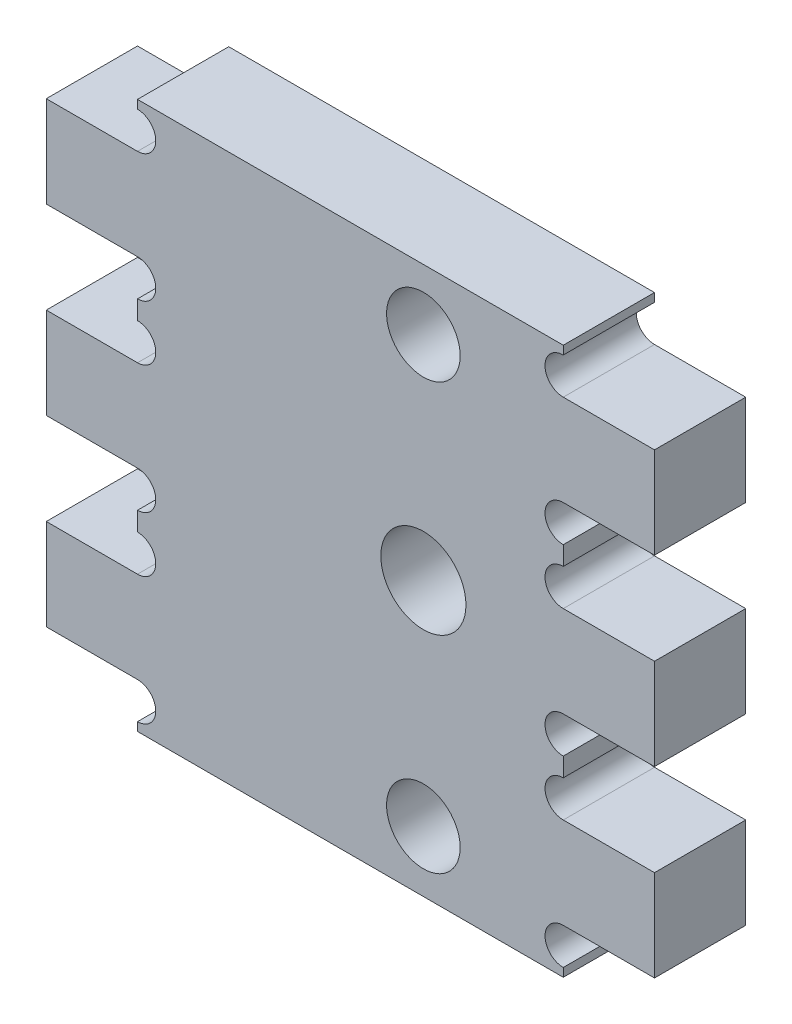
from build123d import *

# Parameters (mm, degrees)
OUTLINE_DEPTH = 15
SKIZZE2_R     = 6.05
SKIZZE2_R_2   = 7
INNER_DEPTH   = 15


with BuildPart() as part:
    # Skizze1 → outline (new body)
    with BuildSketch(Plane.XY):
        with BuildLine():
            Line((96.588113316, 0), (26.588113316, 0))
            Line((26.588113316, 0), (26.588113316, 1.4))
            ThreePointArc((26.588113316, 1.4), (29.588113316, 4.4), (26.588113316, 7.4))
            Line((26.588113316, 7.4), (11.588113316, 7.4))
            Line((11.588113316, 7.4), (11.588113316, 22.4))
            Line((11.588113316, 22.4), (26.588113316, 22.4))
            ThreePointArc((26.588113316, 22.4), (29.588113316, 25.4), (26.588113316, 28.4))
            Line((26.588113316, 28.4), (26.588113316, 31.5))
            ThreePointArc((26.588113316, 31.5), (29.588113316, 34.5), (26.588113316, 37.5))
            Line((26.588113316, 37.5), (11.588113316, 37.5))
            Line((11.588113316, 37.5), (11.588113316, 52.5))
            Line((11.588113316, 52.5), (26.588113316, 52.5))
            ThreePointArc((26.588113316, 52.5), (29.588113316, 55.5), (26.588113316, 58.5))
            Line((26.588113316, 58.5), (26.588113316, 61.6))
            ThreePointArc((26.588113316, 61.6), (29.588113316, 64.6), (26.588113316, 67.6))
            Line((26.588113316, 67.6), (11.588113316, 67.6))
            Line((11.588113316, 67.6), (11.588113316, 82.6))
            Line((11.588113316, 82.6), (26.588113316, 82.6))
            ThreePointArc((26.588113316, 82.6), (29.588113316, 85.6), (26.588113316, 88.6))
            Line((26.588113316, 88.6), (26.588113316, 90))
            Line((26.588113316, 90), (96.588113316, 90))
            Line((96.588113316, 90), (96.588113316, 88.6))
            ThreePointArc((96.588113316, 88.6), (93.588113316, 85.6), (96.588113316, 82.6))
            Line((96.588113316, 82.6), (111.588113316, 82.6))
            Line((111.588113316, 82.6), (111.588113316, 67.6))
            Line((111.588113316, 67.6), (96.588113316, 67.6))
            ThreePointArc((96.588113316, 67.6), (93.588113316, 64.6), (96.588113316, 61.6))
            Line((96.588113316, 61.6), (96.588113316, 58.5))
            ThreePointArc((96.588113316, 58.5), (93.588113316, 55.5), (96.588113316, 52.5))
            Line((96.588113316, 52.5), (111.588113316, 52.5))
            Line((111.588113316, 52.5), (111.588113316, 37.5))
            Line((111.588113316, 37.5), (96.588113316, 37.5))
            ThreePointArc((96.588113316, 37.5), (93.588113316, 34.5), (96.588113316, 31.5))
            Line((96.588113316, 31.5), (96.588113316, 28.4))
            ThreePointArc((96.588113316, 28.4), (93.588113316, 25.4), (96.588113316, 22.4))
            Line((96.588113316, 22.4), (111.588113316, 22.4))
            Line((111.588113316, 22.4), (111.588113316, 7.4))
            Line((111.588113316, 7.4), (96.588113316, 7.4))
            ThreePointArc((96.588113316, 7.4), (93.588113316, 4.4), (96.588113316, 1.4))
            Line((96.588113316, 1.4), (96.588113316, 0))
        make_face()
    extrude(amount=OUTLINE_DEPTH)

    # Skizze2 → inner (cut)
    with BuildSketch(Plane.XY.offset(15)):
        with Locations((73.588113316, 80)):
            Circle(SKIZZE2_R)
        with Locations((73.588113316, 45)):
            Circle(SKIZZE2_R_2)
        with Locations((73.588113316, 10)):
            Circle(SKIZZE2_R)
    extrude(amount=-INNER_DEPTH, mode=Mode.SUBTRACT)


solid = part.part
